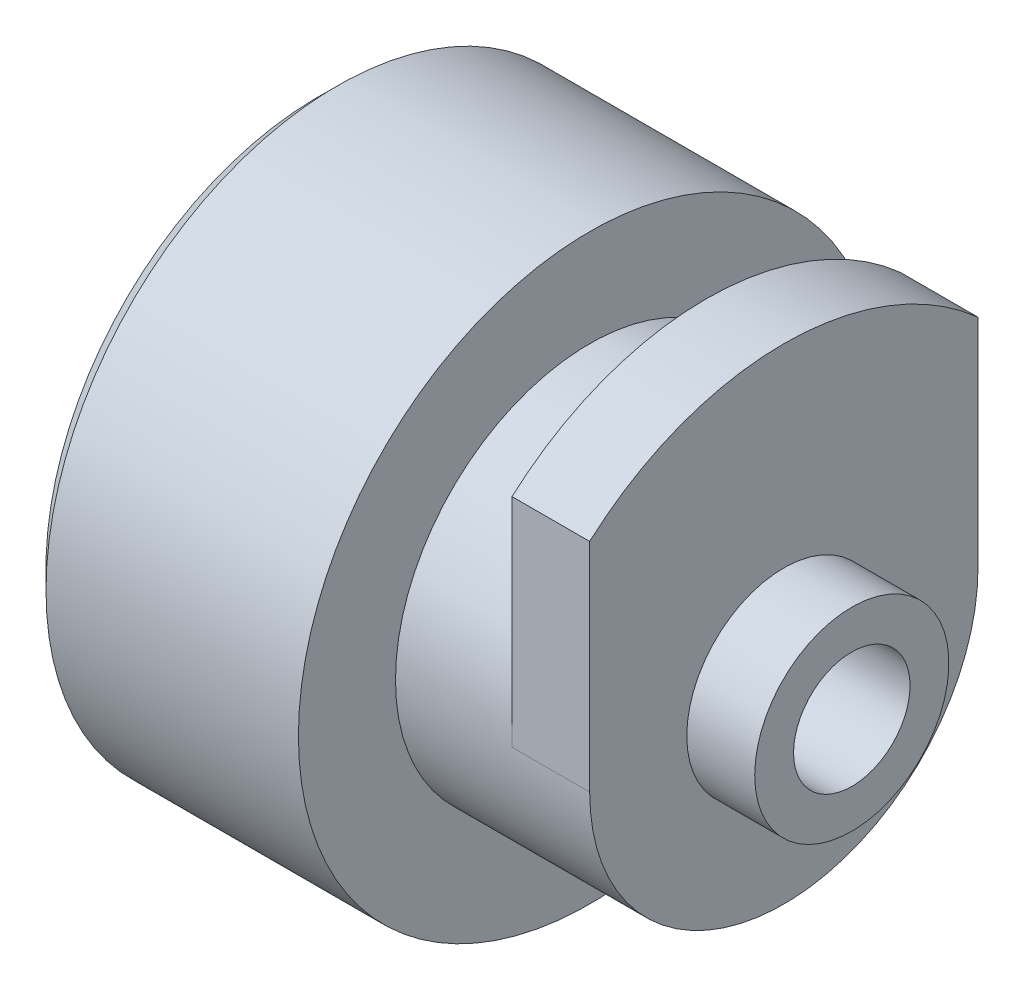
from build123d import *

# Parameters (mm, degrees)
SKETCH2_R          = 10
CUT_EXTRUDE1_DEPTH = 5
SKETCH3_R          = 3
CUT_EXTRUDE2_DEPTH = 31.923292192
CHAMFER1_SIZE      = 1
EXTRUDE1_START     = -4
EXTRUDE1_DEPTH     = 4


with BuildPart() as part:
    # Sketch1 → Revolve1 (revolve)
    with BuildSketch(Plane(origin=(0, 0, 0), x_dir=(1, 0, 0), z_dir=(0, 1, 0)), mode=Mode.PRIVATE) as revolve1_sk:
        Polygon((0, 0), (27.5, 0), (27.5, 5), (24, 5), (24, 10), (14, 10), (14, 15), (0, 15), align=None)
    revolve(revolve1_sk.sketch.rotate(Axis((0, 0, 0), (1, 0, 0)), 180), axis=Axis((0, 0, 0), (1, 0, 0)))

    # Sketch2 → Cut-Extrude1 (cut)
    with BuildSketch(Plane.ZY):
        Circle(SKETCH2_R)
    extrude(amount=-CUT_EXTRUDE1_DEPTH, mode=Mode.SUBTRACT)

    # Sketch3 → Cut-Extrude2 (cut, through all)
    with BuildSketch(Plane.ZY.offset(-5)):
        Circle(SKETCH3_R)
    extrude(amount=-CUT_EXTRUDE2_DEPTH, mode=Mode.SUBTRACT)

    # Chamfer1
    chamfer1_edges = [part.edges().sort_by_distance(p)[0] for p in [
        (0, 0, -15),
    ]]
    chamfer(chamfer1_edges, length=CHAMFER1_SIZE)

    # Sketch4 → Extrude1 (add)
    with BuildSketch(Plane(origin=(24, 0, 0), x_dir=(0, 0, -1), z_dir=(1, 0, 0)).offset(EXTRUDE1_START)):
        with BuildLine():
            Line((-10, 0), (-3, 0))
            ThreePointArc((-3, 0), (0, 3), (3, 0))
            Line((3, 0), (10, 0))
            Line((10, 0), (10, 11.180339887))
            ThreePointArc((10, 11.180339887), (0, 15), (-10, 11.180339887))
            Line((-10, 11.180339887), (-10, 0))
        make_face()
    extrude(amount=EXTRUDE1_DEPTH)


solid = part.part
